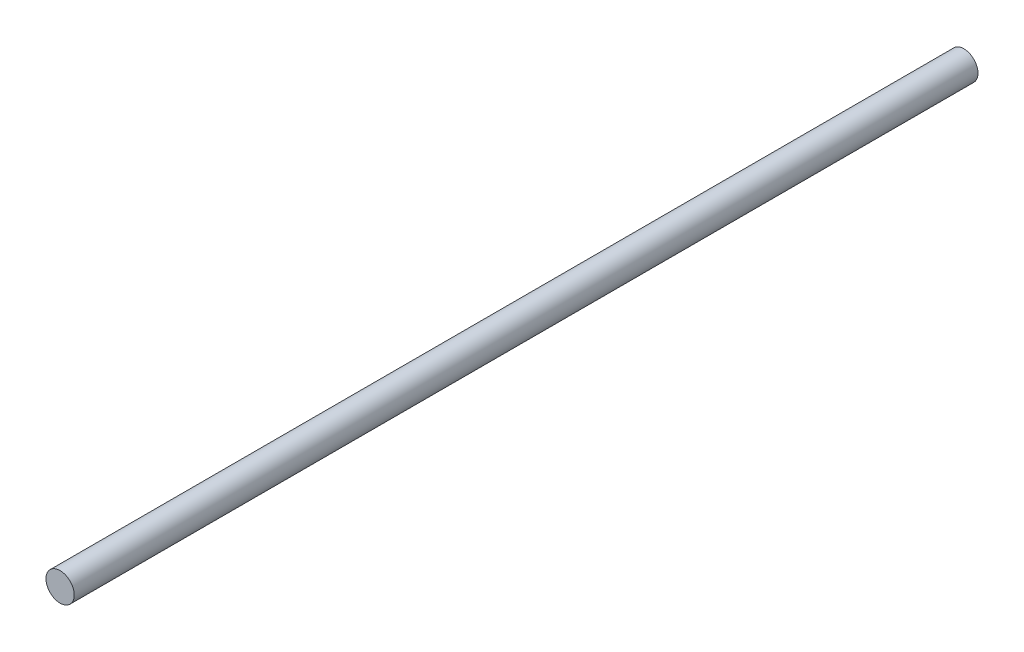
ISO-10303-21;
HEADER;
FILE_DESCRIPTION(('STEP AP214'),'2;1');
FILE_NAME('part.step','',(''),(''),'','','');
FILE_SCHEMA(('AUTOMOTIVE_DESIGN { 1 0 10303 214 1 1 1 1 }'));
ENDSEC;
DATA;
#1=APPLICATION_CONTEXT('core data for automotive mechanical design processes');
#2=APPLICATION_PROTOCOL_DEFINITION('international standard','automotive_design',2000,#1);
#3=PRODUCT_CONTEXT('',#1,'mechanical');
#4=PRODUCT('Part','Part','',(#3));
#5=PRODUCT_RELATED_PRODUCT_CATEGORY('part','',(#4));
#6=PRODUCT_DEFINITION_FORMATION('','',#4);
#7=PRODUCT_DEFINITION_CONTEXT('part definition',#1,'design');
#8=PRODUCT_DEFINITION('design','',#6,#7);
#9=PRODUCT_DEFINITION_SHAPE('','',#8);
#10=(LENGTH_UNIT() NAMED_UNIT(*) SI_UNIT(.MILLI.,.METRE.));
#11=(NAMED_UNIT(*) PLANE_ANGLE_UNIT() SI_UNIT($,.RADIAN.));
#12=(NAMED_UNIT(*) SI_UNIT($,.STERADIAN.) SOLID_ANGLE_UNIT());
#13=UNCERTAINTY_MEASURE_WITH_UNIT(LENGTH_MEASURE(1.E-05),#10,'distance_accuracy_value','');
#14=(GEOMETRIC_REPRESENTATION_CONTEXT(3) GLOBAL_UNCERTAINTY_ASSIGNED_CONTEXT((#13)) GLOBAL_UNIT_ASSIGNED_CONTEXT((#10,
#11,#12)) REPRESENTATION_CONTEXT('',''));
#15=CARTESIAN_POINT('',(0.,0.,0.));
#16=DIRECTION('',(0.,0.,1.));
#17=DIRECTION('',(1.,0.,0.));
#18=AXIS2_PLACEMENT_3D('',#15,#16,#17);
#19=CARTESIAN_POINT('',(0.,0.,50.8));
#20=DIRECTION('',(0.,0.,-1.));
#21=DIRECTION('',(-1.,0.,0.));
#22=AXIS2_PLACEMENT_3D('',#19,#20,#21);
#23=CYLINDRICAL_SURFACE('',#22,0.79375);
#24=CARTESIAN_POINT('',(0.,0.,50.8));
#25=DIRECTION('',(0.,0.,1.));
#26=DIRECTION('',(1.,0.,0.));
#27=AXIS2_PLACEMENT_3D('',#24,#25,#26);
#28=CIRCLE('',#27,0.79375);
#29=CARTESIAN_POINT('',(0.79375,0.,50.8));
#30=VERTEX_POINT('',#29);
#31=EDGE_CURVE('E10',#30,#30,#28,.T.);
#32=ORIENTED_EDGE('',*,*,#31,.F.);
#33=EDGE_LOOP('',(#32));
#34=FACE_BOUND('',#33,.T.);
#35=CARTESIAN_POINT('',(0.,0.,0.));
#36=DIRECTION('',(0.,0.,1.));
#37=DIRECTION('',(1.,0.,0.));
#38=AXIS2_PLACEMENT_3D('',#35,#36,#37);
#39=CIRCLE('',#38,0.79375);
#40=CARTESIAN_POINT('',(0.79375,0.,0.));
#41=VERTEX_POINT('',#40);
#42=EDGE_CURVE('E46',#41,#41,#39,.T.);
#43=ORIENTED_EDGE('',*,*,#42,.T.);
#44=EDGE_LOOP('',(#43));
#45=FACE_BOUND('',#44,.T.);
#46=ADVANCED_FACE('F43',(#34,#45),#23,.T.);
#47=CARTESIAN_POINT('',(0.,0.,50.8));
#48=DIRECTION('',(0.,0.,1.));
#49=DIRECTION('',(1.,0.,0.));
#50=AXIS2_PLACEMENT_3D('',#47,#48,#49);
#51=PLANE('',#50);
#52=ORIENTED_EDGE('',*,*,#31,.T.);
#53=EDGE_LOOP('',(#52));
#54=FACE_BOUND('',#53,.T.);
#55=ADVANCED_FACE('F60',(#54),#51,.T.);
#56=CARTESIAN_POINT('',(0.,0.,0.));
#57=DIRECTION('',(0.,0.,1.));
#58=DIRECTION('',(1.,0.,0.));
#59=AXIS2_PLACEMENT_3D('',#56,#57,#58);
#60=PLANE('',#59);
#61=ORIENTED_EDGE('',*,*,#42,.F.);
#62=EDGE_LOOP('',(#61));
#63=FACE_BOUND('',#62,.T.);
#64=ADVANCED_FACE('F58',(#63),#60,.F.);
#65=CLOSED_SHELL('',(#46,#55,#64));
#66=MANIFOLD_SOLID_BREP('B2',#65);
#67=ADVANCED_BREP_SHAPE_REPRESENTATION('',(#18,#66),#14);
#68=SHAPE_DEFINITION_REPRESENTATION(#9,#67);
ENDSEC;
END-ISO-10303-21;
